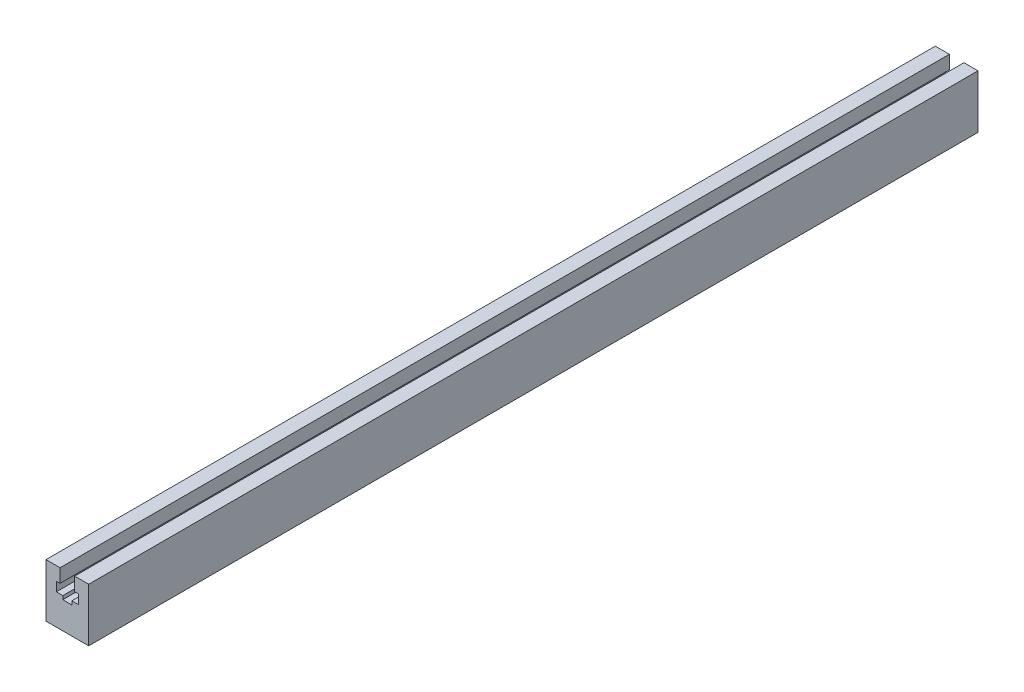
ISO-10303-21;
HEADER;
FILE_DESCRIPTION(('STEP AP214'),'2;1');
FILE_NAME('part.step','',(''),(''),'','','');
FILE_SCHEMA(('AUTOMOTIVE_DESIGN { 1 0 10303 214 1 1 1 1 }'));
ENDSEC;
DATA;
#1=APPLICATION_CONTEXT('core data for automotive mechanical design processes');
#2=APPLICATION_PROTOCOL_DEFINITION('international standard','automotive_design',2000,#1);
#3=PRODUCT_CONTEXT('',#1,'mechanical');
#4=PRODUCT('Part','Part','',(#3));
#5=PRODUCT_RELATED_PRODUCT_CATEGORY('part','',(#4));
#6=PRODUCT_DEFINITION_FORMATION('','',#4);
#7=PRODUCT_DEFINITION_CONTEXT('part definition',#1,'design');
#8=PRODUCT_DEFINITION('design','',#6,#7);
#9=PRODUCT_DEFINITION_SHAPE('','',#8);
#10=(LENGTH_UNIT() NAMED_UNIT(*) SI_UNIT(.MILLI.,.METRE.));
#11=(NAMED_UNIT(*) PLANE_ANGLE_UNIT() SI_UNIT($,.RADIAN.));
#12=(NAMED_UNIT(*) SI_UNIT($,.STERADIAN.) SOLID_ANGLE_UNIT());
#13=UNCERTAINTY_MEASURE_WITH_UNIT(LENGTH_MEASURE(1.E-05),#10,'distance_accuracy_value','');
#14=(GEOMETRIC_REPRESENTATION_CONTEXT(3) GLOBAL_UNCERTAINTY_ASSIGNED_CONTEXT((#13)) GLOBAL_UNIT_ASSIGNED_CONTEXT((#10,
#11,#12)) REPRESENTATION_CONTEXT('',''));
#15=CARTESIAN_POINT('',(0.,0.,0.));
#16=DIRECTION('',(0.,0.,1.));
#17=DIRECTION('',(1.,0.,0.));
#18=AXIS2_PLACEMENT_3D('',#15,#16,#17);
#19=CARTESIAN_POINT('',(-6.2,17.2,0.));
#20=DIRECTION('',(0.,-1.,0.));
#21=DIRECTION('',(1.,0.,0.));
#22=AXIS2_PLACEMENT_3D('',#19,#20,#21);
#23=PLANE('',#22);
#24=DIRECTION('',(1.,0.,0.));
#25=VECTOR('',#24,1.);
#26=CARTESIAN_POINT('',(-6.2,17.2,500.));
#27=LINE('',#26,#25);
#28=CARTESIAN_POINT('',(-6.2,17.2,500.));
#29=VERTEX_POINT('',#28);
#30=CARTESIAN_POINT('',(-2.55,17.2,500.));
#31=VERTEX_POINT('',#30);
#32=EDGE_CURVE('E183',#29,#31,#27,.T.);
#33=ORIENTED_EDGE('',*,*,#32,.T.);
#34=DIRECTION('',(0.,0.,1.));
#35=VECTOR('',#34,1.);
#36=CARTESIAN_POINT('',(-2.55,17.2,0.));
#37=LINE('',#36,#35);
#38=CARTESIAN_POINT('',(-2.55,17.2,0.));
#39=VERTEX_POINT('',#38);
#40=EDGE_CURVE('E155',#39,#31,#37,.T.);
#41=ORIENTED_EDGE('',*,*,#40,.F.);
#42=DIRECTION('',(1.,0.,0.));
#43=VECTOR('',#42,1.);
#44=CARTESIAN_POINT('',(-6.2,17.2,0.));
#45=LINE('',#44,#43);
#46=CARTESIAN_POINT('',(-6.2,17.2,0.));
#47=VERTEX_POINT('',#46);
#48=EDGE_CURVE('E146',#47,#39,#45,.T.);
#49=ORIENTED_EDGE('',*,*,#48,.F.);
#50=DIRECTION('',(0.,0.,1.));
#51=VECTOR('',#50,1.);
#52=CARTESIAN_POINT('',(-6.2,17.2,0.));
#53=LINE('',#52,#51);
#54=EDGE_CURVE('E247',#47,#29,#53,.T.);
#55=ORIENTED_EDGE('',*,*,#54,.T.);
#56=EDGE_LOOP('',(#33,#41,#49,#55));
#57=FACE_BOUND('',#56,.T.);
#58=ADVANCED_FACE('F14',(#57),#23,.F.);
#59=CARTESIAN_POINT('',(-12.,30.,0.));
#60=DIRECTION('',(-1.,0.,0.));
#61=DIRECTION('',(0.,0.,1.));
#62=AXIS2_PLACEMENT_3D('',#59,#60,#61);
#63=PLANE('',#62);
#64=DIRECTION('',(0.,0.,1.));
#65=VECTOR('',#64,1.);
#66=CARTESIAN_POINT('',(-12.,30.,0.));
#67=LINE('',#66,#65);
#68=CARTESIAN_POINT('',(-12.,30.,0.));
#69=VERTEX_POINT('',#68);
#70=CARTESIAN_POINT('',(-12.,30.,500.));
#71=VERTEX_POINT('',#70);
#72=EDGE_CURVE('E9',#69,#71,#67,.T.);
#73=ORIENTED_EDGE('',*,*,#72,.F.);
#74=DIRECTION('',(0.,-1.,0.));
#75=VECTOR('',#74,1.);
#76=CARTESIAN_POINT('',(-12.,30.,0.));
#77=LINE('',#76,#75);
#78=CARTESIAN_POINT('',(-12.,0.,0.));
#79=VERTEX_POINT('',#78);
#80=EDGE_CURVE('E198',#69,#79,#77,.T.);
#81=ORIENTED_EDGE('',*,*,#80,.T.);
#82=DIRECTION('',(0.,0.,1.));
#83=VECTOR('',#82,1.);
#84=CARTESIAN_POINT('',(-12.,0.,0.));
#85=LINE('',#84,#83);
#86=CARTESIAN_POINT('',(-12.,0.,500.));
#87=VERTEX_POINT('',#86);
#88=EDGE_CURVE('E232',#79,#87,#85,.T.);
#89=ORIENTED_EDGE('',*,*,#88,.T.);
#90=DIRECTION('',(0.,-1.,0.));
#91=VECTOR('',#90,1.);
#92=CARTESIAN_POINT('',(-12.,30.,500.));
#93=LINE('',#92,#91);
#94=EDGE_CURVE('E157',#71,#87,#93,.T.);
#95=ORIENTED_EDGE('',*,*,#94,.F.);
#96=EDGE_LOOP('',(#73,#81,#89,#95));
#97=FACE_BOUND('',#96,.T.);
#98=ADVANCED_FACE('F262',(#97),#63,.T.);
#99=CARTESIAN_POINT('',(-12.,30.,0.));
#100=DIRECTION('',(0.,-1.,0.));
#101=DIRECTION('',(1.,0.,0.));
#102=AXIS2_PLACEMENT_3D('',#99,#100,#101);
#103=PLANE('',#102);
#104=DIRECTION('',(0.,0.,1.));
#105=VECTOR('',#104,1.);
#106=CARTESIAN_POINT('',(-4.1,30.,0.));
#107=LINE('',#106,#105);
#108=CARTESIAN_POINT('',(-4.1,30.,0.));
#109=VERTEX_POINT('',#108);
#110=CARTESIAN_POINT('',(-4.1,30.,500.));
#111=VERTEX_POINT('',#110);
#112=EDGE_CURVE('E22',#109,#111,#107,.T.);
#113=ORIENTED_EDGE('',*,*,#112,.F.);
#114=DIRECTION('',(1.,0.,0.));
#115=VECTOR('',#114,1.);
#116=CARTESIAN_POINT('',(-12.,30.,0.));
#117=LINE('',#116,#115);
#118=EDGE_CURVE('E229',#69,#109,#117,.T.);
#119=ORIENTED_EDGE('',*,*,#118,.F.);
#120=ORIENTED_EDGE('',*,*,#72,.T.);
#121=DIRECTION('',(1.,0.,0.));
#122=VECTOR('',#121,1.);
#123=CARTESIAN_POINT('',(-12.,30.,500.));
#124=LINE('',#123,#122);
#125=EDGE_CURVE('E195',#71,#111,#124,.T.);
#126=ORIENTED_EDGE('',*,*,#125,.T.);
#127=EDGE_LOOP('',(#113,#119,#120,#126));
#128=FACE_BOUND('',#127,.T.);
#129=ADVANCED_FACE('F16',(#128),#103,.F.);
#130=CARTESIAN_POINT('',(-4.09999999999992,22.4,0.));
#131=DIRECTION('',(1.,0.,0.));
#132=DIRECTION('',(0.,1.,0.));
#133=AXIS2_PLACEMENT_3D('',#130,#131,#132);
#134=PLANE('',#133);
#135=DIRECTION('',(0.,0.,1.));
#136=VECTOR('',#135,1.);
#137=CARTESIAN_POINT('',(-4.09999999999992,22.4,0.));
#138=LINE('',#137,#136);
#139=CARTESIAN_POINT('',(-4.09999999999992,22.4,0.));
#140=VERTEX_POINT('',#139);
#141=CARTESIAN_POINT('',(-4.09999999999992,22.4,500.));
#142=VERTEX_POINT('',#141);
#143=EDGE_CURVE('E251',#140,#142,#138,.T.);
#144=ORIENTED_EDGE('',*,*,#143,.F.);
#145=DIRECTION('',(0.,1.,0.));
#146=VECTOR('',#145,1.);
#147=CARTESIAN_POINT('',(-4.09999999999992,22.4,0.));
#148=LINE('',#147,#146);
#149=EDGE_CURVE('E226',#140,#109,#148,.T.);
#150=ORIENTED_EDGE('',*,*,#149,.T.);
#151=ORIENTED_EDGE('',*,*,#112,.T.);
#152=DIRECTION('',(0.,1.,0.));
#153=VECTOR('',#152,1.);
#154=CARTESIAN_POINT('',(-4.09999999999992,22.4,500.));
#155=LINE('',#154,#153);
#156=EDGE_CURVE('E192',#142,#111,#155,.T.);
#157=ORIENTED_EDGE('',*,*,#156,.F.);
#158=EDGE_LOOP('',(#144,#150,#151,#157));
#159=FACE_BOUND('',#158,.T.);
#160=ADVANCED_FACE('F254',(#159),#134,.T.);
#161=CARTESIAN_POINT('',(-6.2,22.4,0.));
#162=DIRECTION('',(0.,-1.,0.));
#163=DIRECTION('',(0.,0.,-1.));
#164=AXIS2_PLACEMENT_3D('',#161,#162,#163);
#165=PLANE('',#164);
#166=DIRECTION('',(0.,0.,1.));
#167=VECTOR('',#166,1.);
#168=CARTESIAN_POINT('',(-6.2,22.4,0.));
#169=LINE('',#168,#167);
#170=CARTESIAN_POINT('',(-6.2,22.4,0.));
#171=VERTEX_POINT('',#170);
#172=CARTESIAN_POINT('',(-6.2,22.4,500.));
#173=VERTEX_POINT('',#172);
#174=EDGE_CURVE('E249',#171,#173,#169,.T.);
#175=ORIENTED_EDGE('',*,*,#174,.F.);
#176=DIRECTION('',(1.,0.,0.));
#177=VECTOR('',#176,1.);
#178=CARTESIAN_POINT('',(-6.2,22.4,0.));
#179=LINE('',#178,#177);
#180=EDGE_CURVE('E223',#171,#140,#179,.T.);
#181=ORIENTED_EDGE('',*,*,#180,.T.);
#182=ORIENTED_EDGE('',*,*,#143,.T.);
#183=DIRECTION('',(1.,0.,0.));
#184=VECTOR('',#183,1.);
#185=CARTESIAN_POINT('',(-6.2,22.4,500.));
#186=LINE('',#185,#184);
#187=EDGE_CURVE('E189',#173,#142,#186,.T.);
#188=ORIENTED_EDGE('',*,*,#187,.F.);
#189=EDGE_LOOP('',(#175,#181,#182,#188));
#190=FACE_BOUND('',#189,.T.);
#191=ADVANCED_FACE('F297',(#190),#165,.T.);
#192=CARTESIAN_POINT('',(-6.2,17.2,0.));
#193=DIRECTION('',(1.,0.,0.));
#194=DIRECTION('',(0.,0.,-1.));
#195=AXIS2_PLACEMENT_3D('',#192,#193,#194);
#196=PLANE('',#195);
#197=ORIENTED_EDGE('',*,*,#54,.F.);
#198=DIRECTION('',(0.,1.,0.));
#199=VECTOR('',#198,1.);
#200=CARTESIAN_POINT('',(-6.2,17.2,0.));
#201=LINE('',#200,#199);
#202=EDGE_CURVE('E220',#47,#171,#201,.T.);
#203=ORIENTED_EDGE('',*,*,#202,.T.);
#204=ORIENTED_EDGE('',*,*,#174,.T.);
#205=DIRECTION('',(0.,1.,0.));
#206=VECTOR('',#205,1.);
#207=CARTESIAN_POINT('',(-6.2,17.2,500.));
#208=LINE('',#207,#206);
#209=EDGE_CURVE('E186',#29,#173,#208,.T.);
#210=ORIENTED_EDGE('',*,*,#209,.F.);
#211=EDGE_LOOP('',(#197,#203,#204,#210));
#212=FACE_BOUND('',#211,.T.);
#213=ADVANCED_FACE('F300',(#212),#196,.T.);
#214=CARTESIAN_POINT('',(2.55,17.2,0.));
#215=VERTEX_POINT('',#214);
#216=CARTESIAN_POINT('',(6.2,17.2,0.));
#217=VERTEX_POINT('',#216);
#218=EDGE_CURVE('E218',#215,#217,#45,.T.);
#219=ORIENTED_EDGE('',*,*,#218,.F.);
#220=DIRECTION('',(0.,0.,1.));
#221=VECTOR('',#220,1.);
#222=CARTESIAN_POINT('',(2.55,17.2,0.));
#223=LINE('',#222,#221);
#224=CARTESIAN_POINT('',(2.55,17.2,500.));
#225=VERTEX_POINT('',#224);
#226=EDGE_CURVE('E158',#215,#225,#223,.T.);
#227=ORIENTED_EDGE('',*,*,#226,.T.);
#228=CARTESIAN_POINT('',(6.2,17.2,500.));
#229=VERTEX_POINT('',#228);
#230=EDGE_CURVE('E182',#225,#229,#27,.T.);
#231=ORIENTED_EDGE('',*,*,#230,.T.);
#232=DIRECTION('',(0.,0.,1.));
#233=VECTOR('',#232,1.);
#234=CARTESIAN_POINT('',(6.2,17.2,0.));
#235=LINE('',#234,#233);
#236=EDGE_CURVE('E244',#217,#229,#235,.T.);
#237=ORIENTED_EDGE('',*,*,#236,.F.);
#238=EDGE_LOOP('',(#219,#227,#231,#237));
#239=FACE_BOUND('',#238,.T.);
#240=ADVANCED_FACE('F292',(#239),#23,.F.);
#241=CARTESIAN_POINT('',(6.2,17.2,0.));
#242=DIRECTION('',(1.,0.,0.));
#243=DIRECTION('',(0.,0.,-1.));
#244=AXIS2_PLACEMENT_3D('',#241,#242,#243);
#245=PLANE('',#244);
#246=DIRECTION('',(0.,0.,1.));
#247=VECTOR('',#246,1.);
#248=CARTESIAN_POINT('',(6.2,22.4,0.));
#249=LINE('',#248,#247);
#250=CARTESIAN_POINT('',(6.2,22.4,0.));
#251=VERTEX_POINT('',#250);
#252=CARTESIAN_POINT('',(6.2,22.4,500.));
#253=VERTEX_POINT('',#252);
#254=EDGE_CURVE('E242',#251,#253,#249,.T.);
#255=ORIENTED_EDGE('',*,*,#254,.F.);
#256=DIRECTION('',(0.,1.,0.));
#257=VECTOR('',#256,1.);
#258=CARTESIAN_POINT('',(6.2,17.2,0.));
#259=LINE('',#258,#257);
#260=EDGE_CURVE('E215',#217,#251,#259,.T.);
#261=ORIENTED_EDGE('',*,*,#260,.F.);
#262=ORIENTED_EDGE('',*,*,#236,.T.);
#263=DIRECTION('',(0.,1.,0.));
#264=VECTOR('',#263,1.);
#265=CARTESIAN_POINT('',(6.2,17.2,500.));
#266=LINE('',#265,#264);
#267=EDGE_CURVE('E179',#229,#253,#266,.T.);
#268=ORIENTED_EDGE('',*,*,#267,.T.);
#269=EDGE_LOOP('',(#255,#261,#262,#268));
#270=FACE_BOUND('',#269,.T.);
#271=ADVANCED_FACE('F286',(#270),#245,.F.);
#272=CARTESIAN_POINT('',(4.1,22.4,0.));
#273=DIRECTION('',(0.,-1.,0.));
#274=DIRECTION('',(0.,0.,-1.));
#275=AXIS2_PLACEMENT_3D('',#272,#273,#274);
#276=PLANE('',#275);
#277=DIRECTION('',(0.,0.,1.));
#278=VECTOR('',#277,1.);
#279=CARTESIAN_POINT('',(4.1,22.4,0.));
#280=LINE('',#279,#278);
#281=CARTESIAN_POINT('',(4.1,22.4,0.));
#282=VERTEX_POINT('',#281);
#283=CARTESIAN_POINT('',(4.1,22.4,500.));
#284=VERTEX_POINT('',#283);
#285=EDGE_CURVE('E240',#282,#284,#280,.T.);
#286=ORIENTED_EDGE('',*,*,#285,.F.);
#287=DIRECTION('',(1.,0.,0.));
#288=VECTOR('',#287,1.);
#289=CARTESIAN_POINT('',(4.1,22.4,0.));
#290=LINE('',#289,#288);
#291=EDGE_CURVE('E212',#282,#251,#290,.T.);
#292=ORIENTED_EDGE('',*,*,#291,.T.);
#293=ORIENTED_EDGE('',*,*,#254,.T.);
#294=DIRECTION('',(1.,0.,0.));
#295=VECTOR('',#294,1.);
#296=CARTESIAN_POINT('',(4.1,22.4,500.));
#297=LINE('',#296,#295);
#298=EDGE_CURVE('E176',#284,#253,#297,.T.);
#299=ORIENTED_EDGE('',*,*,#298,.F.);
#300=EDGE_LOOP('',(#286,#292,#293,#299));
#301=FACE_BOUND('',#300,.T.);
#302=ADVANCED_FACE('F283',(#301),#276,.T.);
#303=CARTESIAN_POINT('',(4.1,22.4,0.));
#304=DIRECTION('',(1.,0.,0.));
#305=DIRECTION('',(0.,0.,-1.));
#306=AXIS2_PLACEMENT_3D('',#303,#304,#305);
#307=PLANE('',#306);
#308=DIRECTION('',(0.,0.,1.));
#309=VECTOR('',#308,1.);
#310=CARTESIAN_POINT('',(4.1,30.,0.));
#311=LINE('',#310,#309);
#312=CARTESIAN_POINT('',(4.1,30.,0.));
#313=VERTEX_POINT('',#312);
#314=CARTESIAN_POINT('',(4.1,30.,500.));
#315=VERTEX_POINT('',#314);
#316=EDGE_CURVE('E238',#313,#315,#311,.T.);
#317=ORIENTED_EDGE('',*,*,#316,.F.);
#318=DIRECTION('',(0.,1.,0.));
#319=VECTOR('',#318,1.);
#320=CARTESIAN_POINT('',(4.1,22.4,0.));
#321=LINE('',#320,#319);
#322=EDGE_CURVE('E209',#282,#313,#321,.T.);
#323=ORIENTED_EDGE('',*,*,#322,.F.);
#324=ORIENTED_EDGE('',*,*,#285,.T.);
#325=DIRECTION('',(0.,1.,0.));
#326=VECTOR('',#325,1.);
#327=CARTESIAN_POINT('',(4.1,22.4,500.));
#328=LINE('',#327,#326);
#329=EDGE_CURVE('E173',#284,#315,#328,.T.);
#330=ORIENTED_EDGE('',*,*,#329,.T.);
#331=EDGE_LOOP('',(#317,#323,#324,#330));
#332=FACE_BOUND('',#331,.T.);
#333=ADVANCED_FACE('F278',(#332),#307,.F.);
#334=CARTESIAN_POINT('',(4.1,30.,0.));
#335=DIRECTION('',(0.,-1.,0.));
#336=DIRECTION('',(1.,0.,0.));
#337=AXIS2_PLACEMENT_3D('',#334,#335,#336);
#338=PLANE('',#337);
#339=DIRECTION('',(0.,0.,1.));
#340=VECTOR('',#339,1.);
#341=CARTESIAN_POINT('',(12.,30.,0.));
#342=LINE('',#341,#340);
#343=CARTESIAN_POINT('',(12.,30.,0.));
#344=VERTEX_POINT('',#343);
#345=CARTESIAN_POINT('',(12.,30.,500.));
#346=VERTEX_POINT('',#345);
#347=EDGE_CURVE('E236',#344,#346,#342,.T.);
#348=ORIENTED_EDGE('',*,*,#347,.F.);
#349=DIRECTION('',(1.,0.,0.));
#350=VECTOR('',#349,1.);
#351=CARTESIAN_POINT('',(4.1,30.,0.));
#352=LINE('',#351,#350);
#353=EDGE_CURVE('E206',#313,#344,#352,.T.);
#354=ORIENTED_EDGE('',*,*,#353,.F.);
#355=ORIENTED_EDGE('',*,*,#316,.T.);
#356=DIRECTION('',(1.,0.,0.));
#357=VECTOR('',#356,1.);
#358=CARTESIAN_POINT('',(4.1,30.,500.));
#359=LINE('',#358,#357);
#360=EDGE_CURVE('E170',#315,#346,#359,.T.);
#361=ORIENTED_EDGE('',*,*,#360,.T.);
#362=EDGE_LOOP('',(#348,#354,#355,#361));
#363=FACE_BOUND('',#362,.T.);
#364=ADVANCED_FACE('F274',(#363),#338,.F.);
#365=CARTESIAN_POINT('',(12.,30.,0.));
#366=DIRECTION('',(-1.,0.,0.));
#367=DIRECTION('',(0.,0.,1.));
#368=AXIS2_PLACEMENT_3D('',#365,#366,#367);
#369=PLANE('',#368);
#370=DIRECTION('',(0.,0.,1.));
#371=VECTOR('',#370,1.);
#372=CARTESIAN_POINT('',(12.,0.,0.));
#373=LINE('',#372,#371);
#374=CARTESIAN_POINT('',(12.,0.,0.));
#375=VERTEX_POINT('',#374);
#376=CARTESIAN_POINT('',(12.,0.,500.));
#377=VERTEX_POINT('',#376);
#378=EDGE_CURVE('E234',#375,#377,#373,.T.);
#379=ORIENTED_EDGE('',*,*,#378,.F.);
#380=DIRECTION('',(0.,-1.,0.));
#381=VECTOR('',#380,1.);
#382=CARTESIAN_POINT('',(12.,30.,0.));
#383=LINE('',#382,#381);
#384=EDGE_CURVE('E203',#344,#375,#383,.T.);
#385=ORIENTED_EDGE('',*,*,#384,.F.);
#386=ORIENTED_EDGE('',*,*,#347,.T.);
#387=DIRECTION('',(0.,-1.,0.));
#388=VECTOR('',#387,1.);
#389=CARTESIAN_POINT('',(12.,30.,500.));
#390=LINE('',#389,#388);
#391=EDGE_CURVE('E167',#346,#377,#390,.T.);
#392=ORIENTED_EDGE('',*,*,#391,.T.);
#393=EDGE_LOOP('',(#379,#385,#386,#392));
#394=FACE_BOUND('',#393,.T.);
#395=ADVANCED_FACE('F270',(#394),#369,.F.);
#396=CARTESIAN_POINT('',(-12.,0.,0.));
#397=DIRECTION('',(0.,-1.,0.));
#398=DIRECTION('',(1.,0.,0.));
#399=AXIS2_PLACEMENT_3D('',#396,#397,#398);
#400=PLANE('',#399);
#401=DIRECTION('',(1.,0.,0.));
#402=VECTOR('',#401,1.);
#403=CARTESIAN_POINT('',(-12.,0.,0.));
#404=LINE('',#403,#402);
#405=EDGE_CURVE('E200',#79,#375,#404,.T.);
#406=ORIENTED_EDGE('',*,*,#405,.T.);
#407=ORIENTED_EDGE('',*,*,#378,.T.);
#408=DIRECTION('',(1.,0.,0.));
#409=VECTOR('',#408,1.);
#410=CARTESIAN_POINT('',(-12.,0.,500.));
#411=LINE('',#410,#409);
#412=EDGE_CURVE('E164',#87,#377,#411,.T.);
#413=ORIENTED_EDGE('',*,*,#412,.F.);
#414=ORIENTED_EDGE('',*,*,#88,.F.);
#415=EDGE_LOOP('',(#406,#407,#413,#414));
#416=FACE_BOUND('',#415,.T.);
#417=ADVANCED_FACE('F266',(#416),#400,.T.);
#418=CARTESIAN_POINT('',(-12.,22.4,0.));
#419=DIRECTION('',(0.,0.,1.));
#420=DIRECTION('',(1.,0.,0.));
#421=AXIS2_PLACEMENT_3D('',#418,#419,#420);
#422=PLANE('',#421);
#423=ORIENTED_EDGE('',*,*,#48,.T.);
#424=DIRECTION('',(0.,-1.,0.));
#425=VECTOR('',#424,1.);
#426=CARTESIAN_POINT('',(-2.55,17.2,0.));
#427=LINE('',#426,#425);
#428=CARTESIAN_POINT('',(-2.55,15.2,0.));
#429=VERTEX_POINT('',#428);
#430=EDGE_CURVE('E127',#39,#429,#427,.T.);
#431=ORIENTED_EDGE('',*,*,#430,.T.);
#432=DIRECTION('',(1.,0.,0.));
#433=VECTOR('',#432,1.);
#434=CARTESIAN_POINT('',(-2.55,15.2,0.));
#435=LINE('',#434,#433);
#436=CARTESIAN_POINT('',(2.55,15.2,0.));
#437=VERTEX_POINT('',#436);
#438=EDGE_CURVE('E136',#429,#437,#435,.T.);
#439=ORIENTED_EDGE('',*,*,#438,.T.);
#440=DIRECTION('',(0.,1.,0.));
#441=VECTOR('',#440,1.);
#442=CARTESIAN_POINT('',(2.55,17.2,0.));
#443=LINE('',#442,#441);
#444=EDGE_CURVE('E133',#437,#215,#443,.T.);
#445=ORIENTED_EDGE('',*,*,#444,.T.);
#446=ORIENTED_EDGE('',*,*,#218,.T.);
#447=ORIENTED_EDGE('',*,*,#260,.T.);
#448=ORIENTED_EDGE('',*,*,#291,.F.);
#449=ORIENTED_EDGE('',*,*,#322,.T.);
#450=ORIENTED_EDGE('',*,*,#353,.T.);
#451=ORIENTED_EDGE('',*,*,#384,.T.);
#452=ORIENTED_EDGE('',*,*,#405,.F.);
#453=ORIENTED_EDGE('',*,*,#80,.F.);
#454=ORIENTED_EDGE('',*,*,#118,.T.);
#455=ORIENTED_EDGE('',*,*,#149,.F.);
#456=ORIENTED_EDGE('',*,*,#180,.F.);
#457=ORIENTED_EDGE('',*,*,#202,.F.);
#458=EDGE_LOOP('',(#423,#431,#439,#445,#446,#447,#448,#449,#450,#451,#452,#453,#454,#455,#456,#457));
#459=FACE_BOUND('',#458,.T.);
#460=ADVANCED_FACE('F143',(#459),#422,.F.);
#461=CARTESIAN_POINT('',(-12.,22.4,500.));
#462=DIRECTION('',(0.,0.,1.));
#463=DIRECTION('',(1.,0.,0.));
#464=AXIS2_PLACEMENT_3D('',#461,#462,#463);
#465=PLANE('',#464);
#466=DIRECTION('',(0.,-1.,0.));
#467=VECTOR('',#466,1.);
#468=CARTESIAN_POINT('',(-2.55,17.2,500.));
#469=LINE('',#468,#467);
#470=CARTESIAN_POINT('',(-2.55,15.2,500.));
#471=VERTEX_POINT('',#470);
#472=EDGE_CURVE('E29',#31,#471,#469,.T.);
#473=ORIENTED_EDGE('',*,*,#472,.F.);
#474=ORIENTED_EDGE('',*,*,#32,.F.);
#475=ORIENTED_EDGE('',*,*,#209,.T.);
#476=ORIENTED_EDGE('',*,*,#187,.T.);
#477=ORIENTED_EDGE('',*,*,#156,.T.);
#478=ORIENTED_EDGE('',*,*,#125,.F.);
#479=ORIENTED_EDGE('',*,*,#94,.T.);
#480=ORIENTED_EDGE('',*,*,#412,.T.);
#481=ORIENTED_EDGE('',*,*,#391,.F.);
#482=ORIENTED_EDGE('',*,*,#360,.F.);
#483=ORIENTED_EDGE('',*,*,#329,.F.);
#484=ORIENTED_EDGE('',*,*,#298,.T.);
#485=ORIENTED_EDGE('',*,*,#267,.F.);
#486=ORIENTED_EDGE('',*,*,#230,.F.);
#487=DIRECTION('',(0.,1.,0.));
#488=VECTOR('',#487,1.);
#489=CARTESIAN_POINT('',(2.55,17.2,500.));
#490=LINE('',#489,#488);
#491=CARTESIAN_POINT('',(2.55,15.2,500.));
#492=VERTEX_POINT('',#491);
#493=EDGE_CURVE('E147',#492,#225,#490,.T.);
#494=ORIENTED_EDGE('',*,*,#493,.F.);
#495=DIRECTION('',(1.,0.,0.));
#496=VECTOR('',#495,1.);
#497=CARTESIAN_POINT('',(-2.55,15.2,500.));
#498=LINE('',#497,#496);
#499=EDGE_CURVE('E149',#471,#492,#498,.T.);
#500=ORIENTED_EDGE('',*,*,#499,.F.);
#501=EDGE_LOOP('',(#473,#474,#475,#476,#477,#478,#479,#480,#481,#482,#483,#484,#485,#486,#494,#500));
#502=FACE_BOUND('',#501,.T.);
#503=ADVANCED_FACE('F260',(#502),#465,.T.);
#504=CARTESIAN_POINT('',(-2.55,17.2,0.));
#505=DIRECTION('',(-1.,0.,0.));
#506=DIRECTION('',(0.,0.,1.));
#507=AXIS2_PLACEMENT_3D('',#504,#505,#506);
#508=PLANE('',#507);
#509=ORIENTED_EDGE('',*,*,#472,.T.);
#510=DIRECTION('',(0.,0.,1.));
#511=VECTOR('',#510,1.);
#512=CARTESIAN_POINT('',(-2.55,15.2,0.));
#513=LINE('',#512,#511);
#514=EDGE_CURVE('E123',#429,#471,#513,.T.);
#515=ORIENTED_EDGE('',*,*,#514,.F.);
#516=ORIENTED_EDGE('',*,*,#430,.F.);
#517=ORIENTED_EDGE('',*,*,#40,.T.);
#518=EDGE_LOOP('',(#509,#515,#516,#517));
#519=FACE_BOUND('',#518,.T.);
#520=ADVANCED_FACE('F125',(#519),#508,.F.);
#521=CARTESIAN_POINT('',(2.55,17.2,0.));
#522=DIRECTION('',(1.,0.,0.));
#523=DIRECTION('',(0.,0.,-1.));
#524=AXIS2_PLACEMENT_3D('',#521,#522,#523);
#525=PLANE('',#524);
#526=ORIENTED_EDGE('',*,*,#493,.T.);
#527=ORIENTED_EDGE('',*,*,#226,.F.);
#528=ORIENTED_EDGE('',*,*,#444,.F.);
#529=DIRECTION('',(0.,0.,1.));
#530=VECTOR('',#529,1.);
#531=CARTESIAN_POINT('',(2.55,15.2,0.));
#532=LINE('',#531,#530);
#533=EDGE_CURVE('E132',#437,#492,#532,.T.);
#534=ORIENTED_EDGE('',*,*,#533,.T.);
#535=EDGE_LOOP('',(#526,#527,#528,#534));
#536=FACE_BOUND('',#535,.T.);
#537=ADVANCED_FACE('F294',(#536),#525,.F.);
#538=CARTESIAN_POINT('',(-2.55,15.2,0.));
#539=DIRECTION('',(0.,-1.,0.));
#540=DIRECTION('',(0.,0.,-1.));
#541=AXIS2_PLACEMENT_3D('',#538,#539,#540);
#542=PLANE('',#541);
#543=ORIENTED_EDGE('',*,*,#499,.T.);
#544=ORIENTED_EDGE('',*,*,#533,.F.);
#545=ORIENTED_EDGE('',*,*,#438,.F.);
#546=ORIENTED_EDGE('',*,*,#514,.T.);
#547=EDGE_LOOP('',(#543,#544,#545,#546));
#548=FACE_BOUND('',#547,.T.);
#549=ADVANCED_FACE('F137',(#548),#542,.F.);
#550=CLOSED_SHELL('',(#58,#98,#129,#160,#191,#213,#240,#271,#302,#333,#364,#395,#417,#460,#503,
#520,#537,#549));
#551=MANIFOLD_SOLID_BREP('B1',#550);
#552=ADVANCED_BREP_SHAPE_REPRESENTATION('',(#18,#551),#14);
#553=SHAPE_DEFINITION_REPRESENTATION(#9,#552);
ENDSEC;
END-ISO-10303-21;
